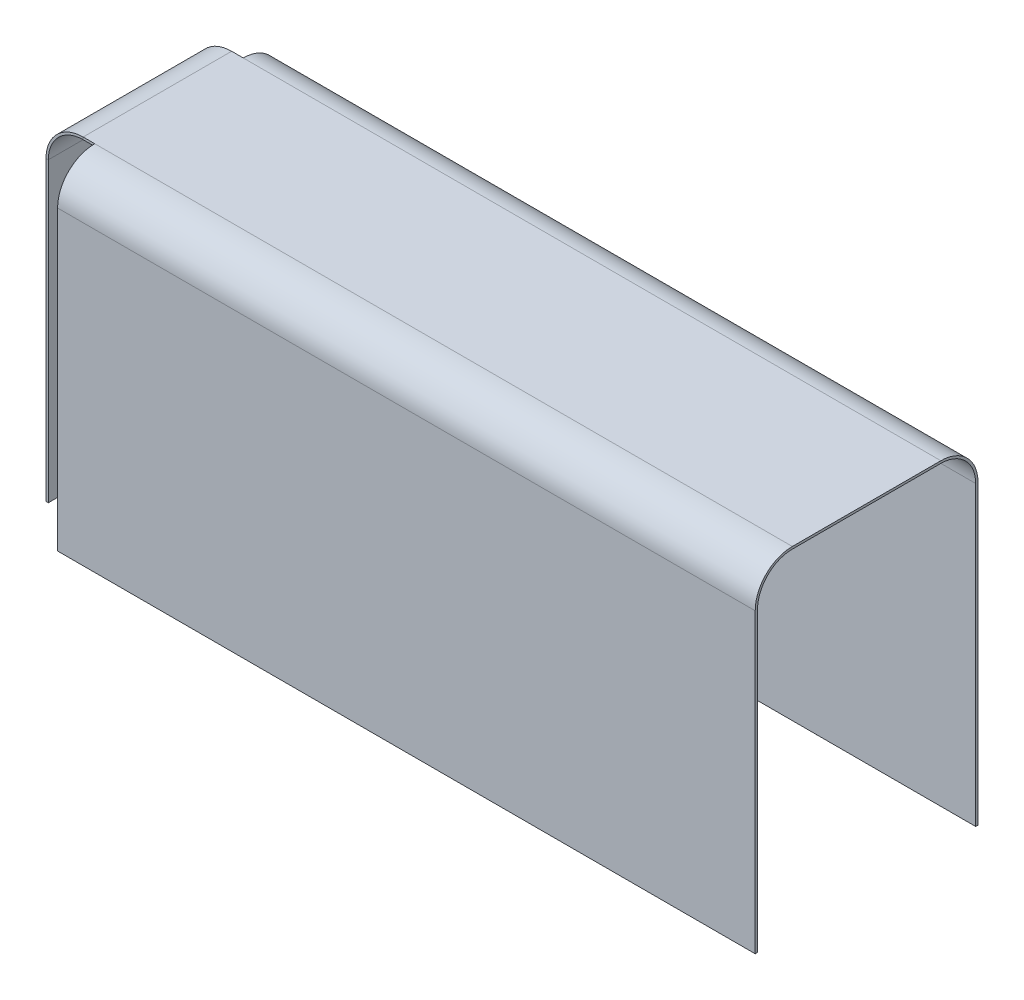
from build123d import *

# Parameters (mm, degrees)
SKETCH1_W           = 238.58855
SKETCH1_H           = 76.2
BOSS_EXTRUDE1_DEPTH = 114.3
FILLET1_R           = 12.7
SHELL1_T            = -0.79375
SKETCH2_W           = 50.8
SKETCH2_H           = 0.79375
SKETCH4_R           = 2.54
CUT_EXTRUDE1_DEPTH  = 2.54


with BuildPart() as part:
    # Sketch1 → Boss-Extrude1 (new body)
    with BuildSketch(Plane(origin=(0, 0, 0), x_dir=(1, 0, 0), z_dir=(0, 1, 0))):
        Rectangle(SKETCH1_W, SKETCH1_H)
    extrude(amount=BOSS_EXTRUDE1_DEPTH)

    # Fillet1
    fillet1_edges = [part.edges().sort_by_distance(p)[0] for p in [
        (0, 114.3, -38.1),
        (0, 114.3, 38.1),
    ]]
    fillet(fillet1_edges, radius=FILLET1_R)

    # Shell1
    shell1_openings = [part.faces().sort_by_distance(p)[0] for p in [
        (0, 0, 0),
        (119.294275, 56.714848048, 0),
        (-119.294275, 56.714848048, 0),
    ]]
    offset(amount=SHELL1_T, openings=shell1_openings, kind=Kind.INTERSECTION)

    # Sweep1: sweep along a path in Sketch3
    with BuildLine(Plane.XY) as sweep1_path:
        Line((-135.963025, 0), (-135.963025, 101.6))
        ThreePointArc((-135.963025, 101.6), (-132.243281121, 110.580256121), (-123.263025, 114.3))
        Line((-123.263025, 114.3), (-119.294275, 114.3))
    # Sketch2 → Sweep1 (sweep)
    with BuildSketch(Plane.ZY.offset(119.294275)):
        with Locations((0, 113.903125)):
            Rectangle(SKETCH2_W, SKETCH2_H)
    sweep(path=sweep1_path.line)

    # Sketch4 → Cut-Extrude1 (cut)
    with BuildSketch(Plane.ZY.offset(135.963025)):
        with Locations((0, 22.5425)):
            Circle(SKETCH4_R)
    extrude(amount=-CUT_EXTRUDE1_DEPTH, mode=Mode.SUBTRACT)


solid = part.part
